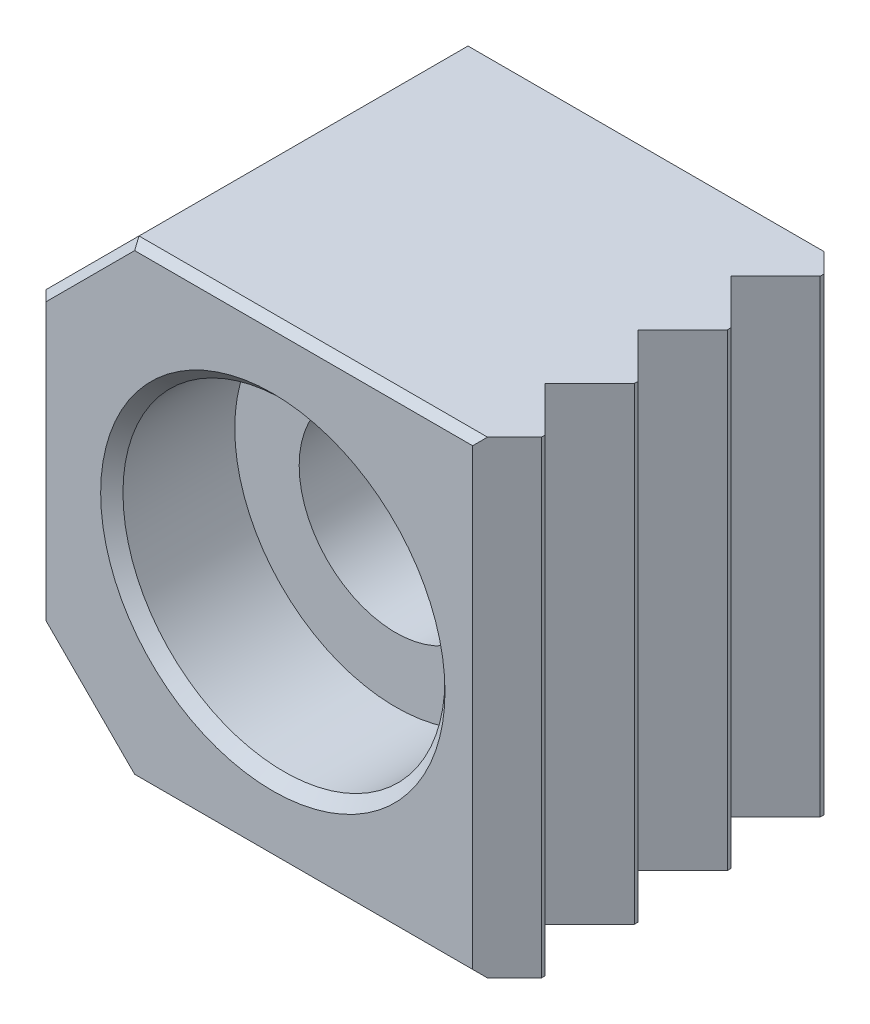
ISO-10303-21;
HEADER;
FILE_DESCRIPTION(('STEP AP214'),'2;1');
FILE_NAME('part.step','',(''),(''),'','','');
FILE_SCHEMA(('AUTOMOTIVE_DESIGN { 1 0 10303 214 1 1 1 1 }'));
ENDSEC;
DATA;
#1=APPLICATION_CONTEXT('core data for automotive mechanical design processes');
#2=APPLICATION_PROTOCOL_DEFINITION('international standard','automotive_design',2000,#1);
#3=PRODUCT_CONTEXT('',#1,'mechanical');
#4=PRODUCT('Part','Part','',(#3));
#5=PRODUCT_RELATED_PRODUCT_CATEGORY('part','',(#4));
#6=PRODUCT_DEFINITION_FORMATION('','',#4);
#7=PRODUCT_DEFINITION_CONTEXT('part definition',#1,'design');
#8=PRODUCT_DEFINITION('design','',#6,#7);
#9=PRODUCT_DEFINITION_SHAPE('','',#8);
#10=(LENGTH_UNIT() NAMED_UNIT(*) SI_UNIT(.MILLI.,.METRE.));
#11=(NAMED_UNIT(*) PLANE_ANGLE_UNIT() SI_UNIT($,.RADIAN.));
#12=(NAMED_UNIT(*) SI_UNIT($,.STERADIAN.) SOLID_ANGLE_UNIT());
#13=UNCERTAINTY_MEASURE_WITH_UNIT(LENGTH_MEASURE(1.E-05),#10,'distance_accuracy_value','');
#14=(GEOMETRIC_REPRESENTATION_CONTEXT(3) GLOBAL_UNCERTAINTY_ASSIGNED_CONTEXT((#13)) GLOBAL_UNIT_ASSIGNED_CONTEXT((#10,
#11,#12)) REPRESENTATION_CONTEXT('',''));
#15=CARTESIAN_POINT('',(0.,0.,0.));
#16=DIRECTION('',(0.,0.,1.));
#17=DIRECTION('',(1.,0.,0.));
#18=AXIS2_PLACEMENT_3D('',#15,#16,#17);
#19=CARTESIAN_POINT('',(8.,-8.,12.));
#20=DIRECTION('',(-1.,0.,0.));
#21=DIRECTION('',(0.,-1.,0.));
#22=AXIS2_PLACEMENT_3D('',#19,#20,#21);
#23=PLANE('',#22);
#24=DIRECTION('',(0.,-1.,0.));
#25=VECTOR('',#24,1.);
#26=CARTESIAN_POINT('',(8.,-8.,7.524));
#27=LINE('',#26,#25);
#28=CARTESIAN_POINT('',(8.,8.,7.524));
#29=VERTEX_POINT('',#28);
#30=CARTESIAN_POINT('',(8.,-8.,7.524));
#31=VERTEX_POINT('',#30);
#32=EDGE_CURVE('E238',#29,#31,#27,.T.);
#33=ORIENTED_EDGE('',*,*,#32,.F.);
#34=DIRECTION('',(0.,0.,-1.));
#35=VECTOR('',#34,1.);
#36=CARTESIAN_POINT('',(8.,8.,12.));
#37=LINE('',#36,#35);
#38=CARTESIAN_POINT('',(8.,8.,7.651));
#39=VERTEX_POINT('',#38);
#40=EDGE_CURVE('E440',#39,#29,#37,.T.);
#41=ORIENTED_EDGE('',*,*,#40,.F.);
#42=DIRECTION('',(0.,1.,0.));
#43=VECTOR('',#42,1.);
#44=CARTESIAN_POINT('',(8.,-8.,7.651));
#45=LINE('',#44,#43);
#46=CARTESIAN_POINT('',(8.,-8.,7.651));
#47=VERTEX_POINT('',#46);
#48=EDGE_CURVE('E236',#47,#39,#45,.T.);
#49=ORIENTED_EDGE('',*,*,#48,.F.);
#50=DIRECTION('',(0.,0.,-1.));
#51=VECTOR('',#50,1.);
#52=CARTESIAN_POINT('',(8.,-8.,12.));
#53=LINE('',#52,#51);
#54=EDGE_CURVE('E197',#47,#31,#53,.T.);
#55=ORIENTED_EDGE('',*,*,#54,.T.);
#56=EDGE_LOOP('',(#33,#41,#49,#55));
#57=FACE_BOUND('',#56,.T.);
#58=ADVANCED_FACE('F15',(#57),#23,.F.);
#59=CARTESIAN_POINT('',(8.,-8.,4.47599999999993));
#60=VERTEX_POINT('',#59);
#61=CARTESIAN_POINT('',(8.,-8.,4.34899999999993));
#62=VERTEX_POINT('',#61);
#63=EDGE_CURVE('E255',#60,#62,#53,.T.);
#64=ORIENTED_EDGE('',*,*,#63,.T.);
#65=DIRECTION('',(0.,1.,0.));
#66=VECTOR('',#65,1.);
#67=CARTESIAN_POINT('',(8.,-8.,4.34899999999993));
#68=LINE('',#67,#66);
#69=CARTESIAN_POINT('',(8.,8.,4.34899999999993));
#70=VERTEX_POINT('',#69);
#71=EDGE_CURVE('E243',#62,#70,#68,.T.);
#72=ORIENTED_EDGE('',*,*,#71,.T.);
#73=CARTESIAN_POINT('',(8.,8.,4.47599999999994));
#74=VERTEX_POINT('',#73);
#75=EDGE_CURVE('E260',#74,#70,#37,.T.);
#76=ORIENTED_EDGE('',*,*,#75,.F.);
#77=DIRECTION('',(0.,-1.,0.));
#78=VECTOR('',#77,1.);
#79=CARTESIAN_POINT('',(8.,-8.,4.47599999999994));
#80=LINE('',#79,#78);
#81=EDGE_CURVE('E240',#74,#60,#80,.T.);
#82=ORIENTED_EDGE('',*,*,#81,.T.);
#83=EDGE_LOOP('',(#64,#72,#76,#82));
#84=FACE_BOUND('',#83,.T.);
#85=ADVANCED_FACE('F413',(#84),#23,.F.);
#86=DIRECTION('',(0.,-1.,0.));
#87=VECTOR('',#86,1.);
#88=CARTESIAN_POINT('',(8.,-8.,10.699));
#89=LINE('',#88,#87);
#90=CARTESIAN_POINT('',(8.,8.,10.699));
#91=VERTEX_POINT('',#90);
#92=CARTESIAN_POINT('',(8.,-8.,10.699));
#93=VERTEX_POINT('',#92);
#94=EDGE_CURVE('E186',#91,#93,#89,.T.);
#95=ORIENTED_EDGE('',*,*,#94,.F.);
#96=CARTESIAN_POINT('',(8.,8.,10.826));
#97=VERTEX_POINT('',#96);
#98=EDGE_CURVE('E261',#97,#91,#37,.T.);
#99=ORIENTED_EDGE('',*,*,#98,.F.);
#100=DIRECTION('',(0.,1.,0.));
#101=VECTOR('',#100,1.);
#102=CARTESIAN_POINT('',(8.,-8.,10.826));
#103=LINE('',#102,#101);
#104=CARTESIAN_POINT('',(8.,-8.,10.826));
#105=VERTEX_POINT('',#104);
#106=EDGE_CURVE('E230',#105,#97,#103,.T.);
#107=ORIENTED_EDGE('',*,*,#106,.F.);
#108=EDGE_CURVE('E256',#105,#93,#53,.T.);
#109=ORIENTED_EDGE('',*,*,#108,.T.);
#110=EDGE_LOOP('',(#95,#99,#107,#109));
#111=FACE_BOUND('',#110,.T.);
#112=ADVANCED_FACE('F418',(#111),#23,.F.);
#113=CARTESIAN_POINT('',(-8.,8.,12.));
#114=DIRECTION('',(0.,1.,0.));
#115=DIRECTION('',(-1.,0.,0.));
#116=AXIS2_PLACEMENT_3D('',#113,#114,#115);
#117=PLANE('',#116);
#118=DIRECTION('',(0.,0.,1.));
#119=VECTOR('',#118,1.);
#120=CARTESIAN_POINT('',(-4.825,8.,12.));
#121=LINE('',#120,#119);
#122=CARTESIAN_POINT('',(-4.825,8.,0.508));
#123=VERTEX_POINT('',#122);
#124=CARTESIAN_POINT('',(-4.825,8.,11.746));
#125=VERTEX_POINT('',#124);
#126=EDGE_CURVE('E268',#123,#125,#121,.T.);
#127=ORIENTED_EDGE('',*,*,#126,.T.);
#128=DIRECTION('',(1.,0.,0.));
#129=VECTOR('',#128,1.);
#130=CARTESIAN_POINT('',(6.826,8.,11.746));
#131=LINE('',#130,#129);
#132=CARTESIAN_POINT('',(7.08,8.,11.746));
#133=VERTEX_POINT('',#132);
#134=EDGE_CURVE('E9',#125,#133,#131,.T.);
#135=ORIENTED_EDGE('',*,*,#134,.T.);
#136=DIRECTION('',(-0.707106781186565,0.,0.70710678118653));
#137=VECTOR('',#136,1.);
#138=CARTESIAN_POINT('',(8.0635,8.,10.7625));
#139=LINE('',#138,#137);
#140=EDGE_CURVE('E214',#97,#133,#139,.T.);
#141=ORIENTED_EDGE('',*,*,#140,.F.);
#142=ORIENTED_EDGE('',*,*,#98,.T.);
#143=DIRECTION('',(0.707106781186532,0.,0.707106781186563));
#144=VECTOR('',#143,1.);
#145=CARTESIAN_POINT('',(6.476,8.,9.175));
#146=LINE('',#145,#144);
#147=CARTESIAN_POINT('',(6.476,8.,9.175));
#148=VERTEX_POINT('',#147);
#149=EDGE_CURVE('E217',#148,#91,#146,.T.);
#150=ORIENTED_EDGE('',*,*,#149,.F.);
#151=DIRECTION('',(-0.707106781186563,0.,0.707106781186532));
#152=VECTOR('',#151,1.);
#153=CARTESIAN_POINT('',(8.0635,8.,7.5875));
#154=LINE('',#153,#152);
#155=EDGE_CURVE('E176',#39,#148,#154,.T.);
#156=ORIENTED_EDGE('',*,*,#155,.F.);
#157=ORIENTED_EDGE('',*,*,#40,.T.);
#158=DIRECTION('',(0.707106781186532,0.,0.707106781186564));
#159=VECTOR('',#158,1.);
#160=CARTESIAN_POINT('',(6.476,8.,6.));
#161=LINE('',#160,#159);
#162=CARTESIAN_POINT('',(6.476,8.,6.));
#163=VERTEX_POINT('',#162);
#164=EDGE_CURVE('E220',#163,#29,#161,.T.);
#165=ORIENTED_EDGE('',*,*,#164,.F.);
#166=DIRECTION('',(0.707106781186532,0.,-0.707106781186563));
#167=VECTOR('',#166,1.);
#168=CARTESIAN_POINT('',(6.476,8.,6.));
#169=LINE('',#168,#167);
#170=EDGE_CURVE('E222',#163,#74,#169,.T.);
#171=ORIENTED_EDGE('',*,*,#170,.T.);
#172=ORIENTED_EDGE('',*,*,#75,.T.);
#173=DIRECTION('',(-0.707106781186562,0.,-0.707106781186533));
#174=VECTOR('',#173,1.);
#175=CARTESIAN_POINT('',(8.0635,8.,4.41249999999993));
#176=LINE('',#175,#174);
#177=CARTESIAN_POINT('',(6.476,8.,2.825));
#178=VERTEX_POINT('',#177);
#179=EDGE_CURVE('E205',#70,#178,#176,.T.);
#180=ORIENTED_EDGE('',*,*,#179,.T.);
#181=DIRECTION('',(0.707106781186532,0.,-0.707106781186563));
#182=VECTOR('',#181,1.);
#183=CARTESIAN_POINT('',(6.476,8.,2.825));
#184=LINE('',#183,#182);
#185=CARTESIAN_POINT('',(8.,8.,1.30099999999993));
#186=VERTEX_POINT('',#185);
#187=EDGE_CURVE('E208',#178,#186,#184,.T.);
#188=ORIENTED_EDGE('',*,*,#187,.T.);
#189=CARTESIAN_POINT('',(8.,8.,1.17399999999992));
#190=VERTEX_POINT('',#189);
#191=EDGE_CURVE('E257',#186,#190,#37,.T.);
#192=ORIENTED_EDGE('',*,*,#191,.T.);
#193=DIRECTION('',(-0.707106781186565,0.,-0.70710678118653));
#194=VECTOR('',#193,1.);
#195=CARTESIAN_POINT('',(8.0635,8.,1.23749999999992));
#196=LINE('',#195,#194);
#197=CARTESIAN_POINT('',(7.334,8.,0.508));
#198=VERTEX_POINT('',#197);
#199=EDGE_CURVE('E211',#190,#198,#196,.T.);
#200=ORIENTED_EDGE('',*,*,#199,.T.);
#201=DIRECTION('',(-1.,0.,0.));
#202=VECTOR('',#201,1.);
#203=CARTESIAN_POINT('',(-8.,8.,0.508));
#204=LINE('',#203,#202);
#205=EDGE_CURVE('E313',#198,#123,#204,.T.);
#206=ORIENTED_EDGE('',*,*,#205,.T.);
#207=EDGE_LOOP('',(#127,#135,#141,#142,#150,#156,#157,#165,#171,#172,#180,#188,#192,#200,#206));
#208=FACE_BOUND('',#207,.T.);
#209=ADVANCED_FACE('F432',(#208),#117,.T.);
#210=CARTESIAN_POINT('',(8.,-8.,12.));
#211=DIRECTION('',(0.,-1.,0.));
#212=DIRECTION('',(1.,0.,0.));
#213=AXIS2_PLACEMENT_3D('',#210,#211,#212);
#214=PLANE('',#213);
#215=DIRECTION('',(-0.707106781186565,0.,0.70710678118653));
#216=VECTOR('',#215,1.);
#217=CARTESIAN_POINT('',(8.0635,-8.,10.7625));
#218=LINE('',#217,#216);
#219=CARTESIAN_POINT('',(7.08,-8.,11.746));
#220=VERTEX_POINT('',#219);
#221=EDGE_CURVE('E190',#105,#220,#218,.T.);
#222=ORIENTED_EDGE('',*,*,#221,.T.);
#223=DIRECTION('',(-1.,0.,0.));
#224=VECTOR('',#223,1.);
#225=CARTESIAN_POINT('',(-4.825,-8.,11.746));
#226=LINE('',#225,#224);
#227=CARTESIAN_POINT('',(-4.825,-8.,11.746));
#228=VERTEX_POINT('',#227);
#229=EDGE_CURVE('E315',#220,#228,#226,.T.);
#230=ORIENTED_EDGE('',*,*,#229,.T.);
#231=DIRECTION('',(0.,0.,-1.));
#232=VECTOR('',#231,1.);
#233=CARTESIAN_POINT('',(-4.825,-8.,0.));
#234=LINE('',#233,#232);
#235=CARTESIAN_POINT('',(-4.825,-8.,0.508));
#236=VERTEX_POINT('',#235);
#237=EDGE_CURVE('E262',#228,#236,#234,.T.);
#238=ORIENTED_EDGE('',*,*,#237,.T.);
#239=DIRECTION('',(1.,0.,0.));
#240=VECTOR('',#239,1.);
#241=CARTESIAN_POINT('',(8.,-8.,0.508));
#242=LINE('',#241,#240);
#243=CARTESIAN_POINT('',(7.334,-8.,0.508));
#244=VERTEX_POINT('',#243);
#245=EDGE_CURVE('E299',#236,#244,#242,.T.);
#246=ORIENTED_EDGE('',*,*,#245,.T.);
#247=DIRECTION('',(-0.707106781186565,0.,-0.70710678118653));
#248=VECTOR('',#247,1.);
#249=CARTESIAN_POINT('',(8.0635,-8.,1.23749999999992));
#250=LINE('',#249,#248);
#251=CARTESIAN_POINT('',(8.,-8.,1.17399999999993));
#252=VERTEX_POINT('',#251);
#253=EDGE_CURVE('E379',#252,#244,#250,.T.);
#254=ORIENTED_EDGE('',*,*,#253,.F.);
#255=CARTESIAN_POINT('',(8.,-8.,1.30099999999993));
#256=VERTEX_POINT('',#255);
#257=EDGE_CURVE('E252',#256,#252,#53,.T.);
#258=ORIENTED_EDGE('',*,*,#257,.F.);
#259=DIRECTION('',(0.707106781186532,0.,-0.707106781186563));
#260=VECTOR('',#259,1.);
#261=CARTESIAN_POINT('',(6.476,-8.,2.825));
#262=LINE('',#261,#260);
#263=CARTESIAN_POINT('',(6.476,-8.,2.825));
#264=VERTEX_POINT('',#263);
#265=EDGE_CURVE('E377',#264,#256,#262,.T.);
#266=ORIENTED_EDGE('',*,*,#265,.F.);
#267=DIRECTION('',(-0.707106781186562,0.,-0.707106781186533));
#268=VECTOR('',#267,1.);
#269=CARTESIAN_POINT('',(8.0635,-8.,4.41249999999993));
#270=LINE('',#269,#268);
#271=EDGE_CURVE('E374',#62,#264,#270,.T.);
#272=ORIENTED_EDGE('',*,*,#271,.F.);
#273=ORIENTED_EDGE('',*,*,#63,.F.);
#274=DIRECTION('',(0.707106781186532,0.,-0.707106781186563));
#275=VECTOR('',#274,1.);
#276=CARTESIAN_POINT('',(6.476,-8.,6.));
#277=LINE('',#276,#275);
#278=CARTESIAN_POINT('',(6.476,-8.,6.));
#279=VERTEX_POINT('',#278);
#280=EDGE_CURVE('E200',#279,#60,#277,.T.);
#281=ORIENTED_EDGE('',*,*,#280,.F.);
#282=DIRECTION('',(0.707106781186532,0.,0.707106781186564));
#283=VECTOR('',#282,1.);
#284=CARTESIAN_POINT('',(6.476,-8.,6.));
#285=LINE('',#284,#283);
#286=EDGE_CURVE('E198',#279,#31,#285,.T.);
#287=ORIENTED_EDGE('',*,*,#286,.T.);
#288=ORIENTED_EDGE('',*,*,#54,.F.);
#289=DIRECTION('',(-0.707106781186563,0.,0.707106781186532));
#290=VECTOR('',#289,1.);
#291=CARTESIAN_POINT('',(8.0635,-8.,7.5875));
#292=LINE('',#291,#290);
#293=CARTESIAN_POINT('',(6.476,-8.,9.175));
#294=VERTEX_POINT('',#293);
#295=EDGE_CURVE('E173',#47,#294,#292,.T.);
#296=ORIENTED_EDGE('',*,*,#295,.T.);
#297=DIRECTION('',(0.707106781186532,0.,0.707106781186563));
#298=VECTOR('',#297,1.);
#299=CARTESIAN_POINT('',(6.476,-8.,9.175));
#300=LINE('',#299,#298);
#301=EDGE_CURVE('E183',#294,#93,#300,.T.);
#302=ORIENTED_EDGE('',*,*,#301,.T.);
#303=ORIENTED_EDGE('',*,*,#108,.F.);
#304=EDGE_LOOP('',(#222,#230,#238,#246,#254,#258,#266,#272,#273,#281,#287,#288,#296,#302,#303));
#305=FACE_BOUND('',#304,.T.);
#306=ADVANCED_FACE('F194',(#305),#214,.T.);
#307=CARTESIAN_POINT('',(8.,8.,12.));
#308=DIRECTION('',(0.,0.,-1.));
#309=DIRECTION('',(1.,0.,0.));
#310=AXIS2_PLACEMENT_3D('',#307,#308,#309);
#311=PLANE('',#310);
#312=CARTESIAN_POINT('',(0.,0.,12.));
#313=DIRECTION('',(0.,0.,-1.));
#314=DIRECTION('',(1.,0.,0.));
#315=AXIS2_PLACEMENT_3D('',#312,#313,#314);
#316=CIRCLE('',#315,5.881);
#317=CARTESIAN_POINT('',(5.881,0.,12.));
#318=VERTEX_POINT('',#317);
#319=EDGE_CURVE('E279',#318,#318,#316,.T.);
#320=ORIENTED_EDGE('',*,*,#319,.T.);
#321=EDGE_LOOP('',(#320));
#322=FACE_BOUND('',#321,.T.);
#323=DIRECTION('',(0.707106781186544,-0.707106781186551,0.));
#324=VECTOR('',#323,1.);
#325=CARTESIAN_POINT('',(-4.64539487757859,-7.82039487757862,12.));
#326=LINE('',#325,#324);
#327=CARTESIAN_POINT('',(-7.746,-4.71978975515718,12.));
#328=VERTEX_POINT('',#327);
#329=CARTESIAN_POINT('',(-4.71978975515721,-7.746,12.));
#330=VERTEX_POINT('',#329);
#331=EDGE_CURVE('E324',#328,#330,#326,.T.);
#332=ORIENTED_EDGE('',*,*,#331,.T.);
#333=DIRECTION('',(1.,0.,0.));
#334=VECTOR('',#333,1.);
#335=CARTESIAN_POINT('',(6.826,-7.746,12.));
#336=LINE('',#335,#334);
#337=CARTESIAN_POINT('',(6.826,-7.746,12.));
#338=VERTEX_POINT('',#337);
#339=EDGE_CURVE('E326',#330,#338,#336,.T.);
#340=ORIENTED_EDGE('',*,*,#339,.T.);
#341=DIRECTION('',(0.,-1.,0.));
#342=VECTOR('',#341,1.);
#343=CARTESIAN_POINT('',(6.826,8.,12.));
#344=LINE('',#343,#342);
#345=CARTESIAN_POINT('',(6.826,7.746,12.));
#346=VERTEX_POINT('',#345);
#347=EDGE_CURVE('E273',#346,#338,#344,.T.);
#348=ORIENTED_EDGE('',*,*,#347,.F.);
#349=DIRECTION('',(-1.,0.,0.));
#350=VECTOR('',#349,1.);
#351=CARTESIAN_POINT('',(-4.825,7.746,12.));
#352=LINE('',#351,#350);
#353=CARTESIAN_POINT('',(-4.71978975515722,7.746,12.));
#354=VERTEX_POINT('',#353);
#355=EDGE_CURVE('E318',#346,#354,#352,.T.);
#356=ORIENTED_EDGE('',*,*,#355,.T.);
#357=DIRECTION('',(-0.707106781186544,-0.707106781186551,0.));
#358=VECTOR('',#357,1.);
#359=CARTESIAN_POINT('',(-7.82039487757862,4.64539487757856,12.));
#360=LINE('',#359,#358);
#361=CARTESIAN_POINT('',(-7.746,4.71978975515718,12.));
#362=VERTEX_POINT('',#361);
#363=EDGE_CURVE('E320',#354,#362,#360,.T.);
#364=ORIENTED_EDGE('',*,*,#363,.T.);
#365=DIRECTION('',(0.,-1.,0.));
#366=VECTOR('',#365,1.);
#367=CARTESIAN_POINT('',(-7.746,8.,12.));
#368=LINE('',#367,#366);
#369=EDGE_CURVE('E322',#362,#328,#368,.T.);
#370=ORIENTED_EDGE('',*,*,#369,.T.);
#371=EDGE_LOOP('',(#332,#340,#348,#356,#364,#370));
#372=FACE_BOUND('',#371,.T.);
#373=ADVANCED_FACE('F390',(#322,#372),#311,.F.);
#374=ORIENTED_EDGE('',*,*,#257,.T.);
#375=DIRECTION('',(0.,1.,0.));
#376=VECTOR('',#375,1.);
#377=CARTESIAN_POINT('',(8.,-8.,1.17399999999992));
#378=LINE('',#377,#376);
#379=EDGE_CURVE('E225',#252,#190,#378,.T.);
#380=ORIENTED_EDGE('',*,*,#379,.T.);
#381=ORIENTED_EDGE('',*,*,#191,.F.);
#382=DIRECTION('',(0.,-1.,0.));
#383=VECTOR('',#382,1.);
#384=CARTESIAN_POINT('',(8.,-8.,1.30099999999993));
#385=LINE('',#384,#383);
#386=EDGE_CURVE('E232',#186,#256,#385,.T.);
#387=ORIENTED_EDGE('',*,*,#386,.T.);
#388=EDGE_LOOP('',(#374,#380,#381,#387));
#389=FACE_BOUND('',#388,.T.);
#390=ADVANCED_FACE('F17',(#389),#23,.F.);
#391=CARTESIAN_POINT('',(-8.,8.,12.));
#392=DIRECTION('',(1.,0.,0.));
#393=DIRECTION('',(0.,1.,0.));
#394=AXIS2_PLACEMENT_3D('',#391,#392,#393);
#395=PLANE('',#394);
#396=DIRECTION('',(0.,0.,1.));
#397=VECTOR('',#396,1.);
#398=CARTESIAN_POINT('',(-8.,-4.825,12.));
#399=LINE('',#398,#397);
#400=CARTESIAN_POINT('',(-8.,-4.825,0.508));
#401=VERTEX_POINT('',#400);
#402=CARTESIAN_POINT('',(-8.,-4.825,11.746));
#403=VERTEX_POINT('',#402);
#404=EDGE_CURVE('E266',#401,#403,#399,.T.);
#405=ORIENTED_EDGE('',*,*,#404,.T.);
#406=DIRECTION('',(0.,1.,0.));
#407=VECTOR('',#406,1.);
#408=CARTESIAN_POINT('',(-8.,8.,11.746));
#409=LINE('',#408,#407);
#410=CARTESIAN_POINT('',(-8.,4.82499999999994,11.746));
#411=VERTEX_POINT('',#410);
#412=EDGE_CURVE('E37',#403,#411,#409,.T.);
#413=ORIENTED_EDGE('',*,*,#412,.T.);
#414=DIRECTION('',(0.,0.,-1.));
#415=VECTOR('',#414,1.);
#416=CARTESIAN_POINT('',(-8.,4.82499999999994,0.));
#417=LINE('',#416,#415);
#418=CARTESIAN_POINT('',(-8.,4.82499999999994,0.508));
#419=VERTEX_POINT('',#418);
#420=EDGE_CURVE('E264',#411,#419,#417,.T.);
#421=ORIENTED_EDGE('',*,*,#420,.T.);
#422=DIRECTION('',(0.,-1.,0.));
#423=VECTOR('',#422,1.);
#424=CARTESIAN_POINT('',(-8.,-4.825,0.508));
#425=LINE('',#424,#423);
#426=EDGE_CURVE('E308',#419,#401,#425,.T.);
#427=ORIENTED_EDGE('',*,*,#426,.T.);
#428=EDGE_LOOP('',(#405,#413,#421,#427));
#429=FACE_BOUND('',#428,.T.);
#430=ADVANCED_FACE('F343',(#429),#395,.F.);
#431=CARTESIAN_POINT('',(8.,8.,0.));
#432=DIRECTION('',(0.,0.,-1.));
#433=DIRECTION('',(1.,0.,0.));
#434=AXIS2_PLACEMENT_3D('',#431,#432,#433);
#435=PLANE('',#434);
#436=CARTESIAN_POINT('',(0.,0.,0.));
#437=DIRECTION('',(0.,0.,-1.));
#438=DIRECTION('',(1.,0.,0.));
#439=AXIS2_PLACEMENT_3D('',#436,#437,#438);
#440=CIRCLE('',#439,3.681);
#441=CARTESIAN_POINT('',(3.681,0.,0.));
#442=VERTEX_POINT('',#441);
#443=EDGE_CURVE('E282',#442,#442,#440,.F.);
#444=ORIENTED_EDGE('',*,*,#443,.T.);
#445=EDGE_LOOP('',(#444));
#446=FACE_BOUND('',#445,.T.);
#447=DIRECTION('',(0.,1.,0.));
#448=VECTOR('',#447,1.);
#449=CARTESIAN_POINT('',(6.826,8.,0.));
#450=LINE('',#449,#448);
#451=CARTESIAN_POINT('',(6.826,-7.492,0.));
#452=VERTEX_POINT('',#451);
#453=CARTESIAN_POINT('',(6.826,7.492,0.));
#454=VERTEX_POINT('',#453);
#455=EDGE_CURVE('E270',#452,#454,#450,.T.);
#456=ORIENTED_EDGE('',*,*,#455,.F.);
#457=DIRECTION('',(-1.,0.,0.));
#458=VECTOR('',#457,1.);
#459=CARTESIAN_POINT('',(8.,-7.492,0.));
#460=LINE('',#459,#458);
#461=CARTESIAN_POINT('',(-4.61457951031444,-7.492,0.));
#462=VERTEX_POINT('',#461);
#463=EDGE_CURVE('E296',#452,#462,#460,.T.);
#464=ORIENTED_EDGE('',*,*,#463,.T.);
#465=DIRECTION('',(-0.707106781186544,0.707106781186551,0.));
#466=VECTOR('',#465,1.);
#467=CARTESIAN_POINT('',(-6.05328975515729,-6.05328975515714,0.));
#468=LINE('',#467,#466);
#469=CARTESIAN_POINT('',(-7.492,-4.61457951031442,0.));
#470=VERTEX_POINT('',#469);
#471=EDGE_CURVE('E294',#462,#470,#468,.T.);
#472=ORIENTED_EDGE('',*,*,#471,.T.);
#473=DIRECTION('',(0.,1.,0.));
#474=VECTOR('',#473,1.);
#475=CARTESIAN_POINT('',(-7.492,4.82499999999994,0.));
#476=LINE('',#475,#474);
#477=CARTESIAN_POINT('',(-7.492,4.61457951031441,0.));
#478=VERTEX_POINT('',#477);
#479=EDGE_CURVE('E292',#470,#478,#476,.T.);
#480=ORIENTED_EDGE('',*,*,#479,.T.);
#481=DIRECTION('',(0.707106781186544,0.707106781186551,0.));
#482=VECTOR('',#481,1.);
#483=CARTESIAN_POINT('',(1.94671024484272,14.0532897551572,0.));
#484=LINE('',#483,#482);
#485=CARTESIAN_POINT('',(-4.61457951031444,7.492,0.));
#486=VERTEX_POINT('',#485);
#487=EDGE_CURVE('E290',#478,#486,#484,.T.);
#488=ORIENTED_EDGE('',*,*,#487,.T.);
#489=DIRECTION('',(1.,0.,0.));
#490=VECTOR('',#489,1.);
#491=CARTESIAN_POINT('',(8.,7.492,0.));
#492=LINE('',#491,#490);
#493=EDGE_CURVE('E288',#486,#454,#492,.T.);
#494=ORIENTED_EDGE('',*,*,#493,.T.);
#495=EDGE_LOOP('',(#456,#464,#472,#480,#488,#494));
#496=FACE_BOUND('',#495,.T.);
#497=ADVANCED_FACE('F427',(#446,#496),#435,.T.);
#498=CARTESIAN_POINT('',(-4.825,-8.,12.));
#499=DIRECTION('',(-0.707106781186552,-0.707106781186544,0.));
#500=DIRECTION('',(0.707106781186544,-0.707106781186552,0.));
#501=AXIS2_PLACEMENT_3D('',#498,#499,#500);
#502=PLANE('',#501);
#503=ORIENTED_EDGE('',*,*,#237,.F.);
#504=DIRECTION('',(-0.707106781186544,0.707106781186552,0.));
#505=VECTOR('',#504,1.);
#506=CARTESIAN_POINT('',(-8.,-4.82499999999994,11.746));
#507=LINE('',#506,#505);
#508=EDGE_CURVE('E332',#228,#403,#507,.T.);
#509=ORIENTED_EDGE('',*,*,#508,.T.);
#510=ORIENTED_EDGE('',*,*,#404,.F.);
#511=DIRECTION('',(0.707106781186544,-0.707106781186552,0.));
#512=VECTOR('',#511,1.);
#513=CARTESIAN_POINT('',(-4.825,-8.,0.508));
#514=LINE('',#513,#512);
#515=EDGE_CURVE('E305',#401,#236,#514,.T.);
#516=ORIENTED_EDGE('',*,*,#515,.T.);
#517=EDGE_LOOP('',(#503,#509,#510,#516));
#518=FACE_BOUND('',#517,.T.);
#519=ADVANCED_FACE('F338',(#518),#502,.T.);
#520=CARTESIAN_POINT('',(-8.,4.82499999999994,12.));
#521=DIRECTION('',(-0.707106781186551,0.707106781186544,0.));
#522=DIRECTION('',(-0.707106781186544,-0.707106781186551,0.));
#523=AXIS2_PLACEMENT_3D('',#520,#521,#522);
#524=PLANE('',#523);
#525=ORIENTED_EDGE('',*,*,#420,.F.);
#526=DIRECTION('',(0.707106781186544,0.707106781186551,0.));
#527=VECTOR('',#526,1.);
#528=CARTESIAN_POINT('',(-4.825,8.,11.746));
#529=LINE('',#528,#527);
#530=EDGE_CURVE('E23',#411,#125,#529,.T.);
#531=ORIENTED_EDGE('',*,*,#530,.T.);
#532=ORIENTED_EDGE('',*,*,#126,.F.);
#533=DIRECTION('',(-0.707106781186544,-0.707106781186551,0.));
#534=VECTOR('',#533,1.);
#535=CARTESIAN_POINT('',(-8.,4.82499999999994,0.508));
#536=LINE('',#535,#534);
#537=EDGE_CURVE('E310',#123,#419,#536,.T.);
#538=ORIENTED_EDGE('',*,*,#537,.T.);
#539=EDGE_LOOP('',(#525,#531,#532,#538));
#540=FACE_BOUND('',#539,.T.);
#541=ADVANCED_FACE('F472',(#540),#524,.T.);
#542=CARTESIAN_POINT('',(0.,0.,7.8));
#543=DIRECTION('',(0.,0.,1.));
#544=DIRECTION('',(-1.,0.,0.));
#545=AXIS2_PLACEMENT_3D('',#542,#543,#544);
#546=CYLINDRICAL_SURFACE('',#545,5.5);
#547=CARTESIAN_POINT('',(0.,0.,11.619));
#548=DIRECTION('',(0.,0.,-1.));
#549=DIRECTION('',(1.,0.,0.));
#550=AXIS2_PLACEMENT_3D('',#547,#548,#549);
#551=CIRCLE('',#550,5.5);
#552=CARTESIAN_POINT('',(5.5,0.,11.619));
#553=VERTEX_POINT('',#552);
#554=EDGE_CURVE('E276',#553,#553,#551,.F.);
#555=ORIENTED_EDGE('',*,*,#554,.T.);
#556=EDGE_LOOP('',(#555));
#557=FACE_BOUND('',#556,.T.);
#558=CARTESIAN_POINT('',(0.,0.,7.8));
#559=DIRECTION('',(0.,0.,1.));
#560=DIRECTION('',(-1.,0.,0.));
#561=AXIS2_PLACEMENT_3D('',#558,#559,#560);
#562=CIRCLE('',#561,5.5);
#563=CARTESIAN_POINT('',(-5.5,0.,7.8));
#564=VERTEX_POINT('',#563);
#565=EDGE_CURVE('E249',#564,#564,#562,.T.);
#566=ORIENTED_EDGE('',*,*,#565,.F.);
#567=EDGE_LOOP('',(#566));
#568=FACE_BOUND('',#567,.T.);
#569=ADVANCED_FACE('F474',(#557,#568),#546,.F.);
#570=CARTESIAN_POINT('',(0.,0.,7.8));
#571=DIRECTION('',(0.,0.,1.));
#572=DIRECTION('',(-1.,0.,0.));
#573=AXIS2_PLACEMENT_3D('',#570,#571,#572);
#574=PLANE('',#573);
#575=CARTESIAN_POINT('',(0.,0.,7.8));
#576=DIRECTION('',(0.,0.,1.));
#577=DIRECTION('',(-1.,0.,0.));
#578=AXIS2_PLACEMENT_3D('',#575,#576,#577);
#579=CIRCLE('',#578,3.3);
#580=CARTESIAN_POINT('',(-3.3,0.,7.8));
#581=VERTEX_POINT('',#580);
#582=EDGE_CURVE('E246',#581,#581,#579,.T.);
#583=ORIENTED_EDGE('',*,*,#582,.F.);
#584=EDGE_LOOP('',(#583));
#585=FACE_BOUND('',#584,.T.);
#586=ORIENTED_EDGE('',*,*,#565,.T.);
#587=EDGE_LOOP('',(#586));
#588=FACE_BOUND('',#587,.T.);
#589=ADVANCED_FACE('F480',(#585,#588),#574,.T.);
#590=CARTESIAN_POINT('',(0.,0.,0.));
#591=DIRECTION('',(0.,0.,1.));
#592=DIRECTION('',(-1.,0.,0.));
#593=AXIS2_PLACEMENT_3D('',#590,#591,#592);
#594=CYLINDRICAL_SURFACE('',#593,3.3);
#595=CARTESIAN_POINT('',(0.,0.,0.381));
#596=DIRECTION('',(0.,0.,-1.));
#597=DIRECTION('',(1.,0.,0.));
#598=AXIS2_PLACEMENT_3D('',#595,#596,#597);
#599=CIRCLE('',#598,3.3);
#600=CARTESIAN_POINT('',(3.3,0.,0.381));
#601=VERTEX_POINT('',#600);
#602=EDGE_CURVE('E285',#601,#601,#599,.T.);
#603=ORIENTED_EDGE('',*,*,#602,.T.);
#604=EDGE_LOOP('',(#603));
#605=FACE_BOUND('',#604,.T.);
#606=ORIENTED_EDGE('',*,*,#582,.T.);
#607=EDGE_LOOP('',(#606));
#608=FACE_BOUND('',#607,.T.);
#609=ADVANCED_FACE('F549',(#605,#608),#594,.F.);
#610=CARTESIAN_POINT('',(8.0635,8.,1.23749999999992));
#611=DIRECTION('',(-0.70710678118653,0.,0.707106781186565));
#612=DIRECTION('',(-0.707106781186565,0.,-0.70710678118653));
#613=AXIS2_PLACEMENT_3D('',#610,#611,#612);
#614=PLANE('',#613);
#615=ORIENTED_EDGE('',*,*,#253,.T.);
#616=DIRECTION('',(0.577350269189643,-0.57735026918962,0.577350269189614));
#617=VECTOR('',#616,1.);
#618=CARTESIAN_POINT('',(7.21733333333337,-7.88333333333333,0.39133333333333));
#619=LINE('',#618,#617);
#620=EDGE_CURVE('E303',#244,#452,#619,.F.);
#621=ORIENTED_EDGE('',*,*,#620,.T.);
#622=ORIENTED_EDGE('',*,*,#455,.T.);
#623=DIRECTION('',(-0.577350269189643,-0.57735026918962,-0.577350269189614));
#624=VECTOR('',#623,1.);
#625=CARTESIAN_POINT('',(7.21733333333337,7.88333333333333,0.39133333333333));
#626=LINE('',#625,#624);
#627=EDGE_CURVE('E301',#454,#198,#626,.F.);
#628=ORIENTED_EDGE('',*,*,#627,.T.);
#629=ORIENTED_EDGE('',*,*,#199,.F.);
#630=ORIENTED_EDGE('',*,*,#379,.F.);
#631=EDGE_LOOP('',(#615,#621,#622,#628,#629,#630));
#632=FACE_BOUND('',#631,.T.);
#633=ADVANCED_FACE('F558',(#632),#614,.F.);
#634=CARTESIAN_POINT('',(8.0635,8.,10.7625));
#635=DIRECTION('',(0.70710678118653,0.,0.707106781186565));
#636=DIRECTION('',(-0.707106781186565,0.,0.70710678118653));
#637=AXIS2_PLACEMENT_3D('',#634,#635,#636);
#638=PLANE('',#637);
#639=ORIENTED_EDGE('',*,*,#347,.T.);
#640=DIRECTION('',(0.577350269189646,-0.577350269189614,-0.577350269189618));
#641=VECTOR('',#640,1.);
#642=CARTESIAN_POINT('',(2.40233333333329,-3.32233333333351,16.4236666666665));
#643=LINE('',#642,#641);
#644=EDGE_CURVE('E330',#338,#220,#643,.T.);
#645=ORIENTED_EDGE('',*,*,#644,.T.);
#646=ORIENTED_EDGE('',*,*,#221,.F.);
#647=ORIENTED_EDGE('',*,*,#106,.T.);
#648=ORIENTED_EDGE('',*,*,#140,.T.);
#649=DIRECTION('',(-0.577350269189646,-0.577350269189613,0.577350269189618));
#650=VECTOR('',#649,1.);
#651=CARTESIAN_POINT('',(7.7356666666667,8.65566666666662,11.0903333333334));
#652=LINE('',#651,#650);
#653=EDGE_CURVE('E328',#133,#346,#652,.T.);
#654=ORIENTED_EDGE('',*,*,#653,.T.);
#655=EDGE_LOOP('',(#639,#645,#646,#647,#648,#654));
#656=FACE_BOUND('',#655,.T.);
#657=ADVANCED_FACE('F392',(#656),#638,.T.);
#658=CARTESIAN_POINT('',(6.476,8.,2.825));
#659=DIRECTION('',(-0.707106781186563,0.,-0.707106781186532));
#660=DIRECTION('',(0.707106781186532,0.,-0.707106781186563));
#661=AXIS2_PLACEMENT_3D('',#658,#659,#660);
#662=PLANE('',#661);
#663=ORIENTED_EDGE('',*,*,#187,.F.);
#664=DIRECTION('',(0.,-1.,0.));
#665=VECTOR('',#664,1.);
#666=CARTESIAN_POINT('',(6.476,8.,2.825));
#667=LINE('',#666,#665);
#668=EDGE_CURVE('E180',#178,#264,#667,.T.);
#669=ORIENTED_EDGE('',*,*,#668,.T.);
#670=ORIENTED_EDGE('',*,*,#265,.T.);
#671=ORIENTED_EDGE('',*,*,#386,.F.);
#672=EDGE_LOOP('',(#663,#669,#670,#671));
#673=FACE_BOUND('',#672,.T.);
#674=ADVANCED_FACE('F458',(#673),#662,.F.);
#675=CARTESIAN_POINT('',(8.0635,8.,4.41249999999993));
#676=DIRECTION('',(-0.707106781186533,0.,0.707106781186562));
#677=DIRECTION('',(-0.707106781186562,0.,-0.707106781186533));
#678=AXIS2_PLACEMENT_3D('',#675,#676,#677);
#679=PLANE('',#678);
#680=ORIENTED_EDGE('',*,*,#271,.T.);
#681=ORIENTED_EDGE('',*,*,#668,.F.);
#682=ORIENTED_EDGE('',*,*,#179,.F.);
#683=ORIENTED_EDGE('',*,*,#71,.F.);
#684=EDGE_LOOP('',(#680,#681,#682,#683));
#685=FACE_BOUND('',#684,.T.);
#686=ADVANCED_FACE('F451',(#685),#679,.F.);
#687=CARTESIAN_POINT('',(6.476,8.,9.175));
#688=DIRECTION('',(0.707106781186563,0.,-0.707106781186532));
#689=DIRECTION('',(0.707106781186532,0.,0.707106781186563));
#690=AXIS2_PLACEMENT_3D('',#687,#688,#689);
#691=PLANE('',#690);
#692=ORIENTED_EDGE('',*,*,#94,.T.);
#693=ORIENTED_EDGE('',*,*,#301,.F.);
#694=DIRECTION('',(0.,-1.,0.));
#695=VECTOR('',#694,1.);
#696=CARTESIAN_POINT('',(6.476,8.,9.175));
#697=LINE('',#696,#695);
#698=EDGE_CURVE('E169',#148,#294,#697,.T.);
#699=ORIENTED_EDGE('',*,*,#698,.F.);
#700=ORIENTED_EDGE('',*,*,#149,.T.);
#701=EDGE_LOOP('',(#692,#693,#699,#700));
#702=FACE_BOUND('',#701,.T.);
#703=ADVANCED_FACE('F184',(#702),#691,.T.);
#704=CARTESIAN_POINT('',(8.0635,8.,7.5875));
#705=DIRECTION('',(0.707106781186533,0.,0.707106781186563));
#706=DIRECTION('',(-0.707106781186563,0.,0.707106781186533));
#707=AXIS2_PLACEMENT_3D('',#704,#705,#706);
#708=PLANE('',#707);
#709=ORIENTED_EDGE('',*,*,#48,.T.);
#710=ORIENTED_EDGE('',*,*,#155,.T.);
#711=ORIENTED_EDGE('',*,*,#698,.T.);
#712=ORIENTED_EDGE('',*,*,#295,.F.);
#713=EDGE_LOOP('',(#709,#710,#711,#712));
#714=FACE_BOUND('',#713,.T.);
#715=ADVANCED_FACE('F171',(#714),#708,.T.);
#716=CARTESIAN_POINT('',(6.476,8.,6.));
#717=DIRECTION('',(-0.707106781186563,0.,-0.707106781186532));
#718=DIRECTION('',(0.707106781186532,0.,-0.707106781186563));
#719=AXIS2_PLACEMENT_3D('',#716,#717,#718);
#720=PLANE('',#719);
#721=ORIENTED_EDGE('',*,*,#170,.F.);
#722=DIRECTION('',(0.,-1.,0.));
#723=VECTOR('',#722,1.);
#724=CARTESIAN_POINT('',(6.476,8.,6.));
#725=LINE('',#724,#723);
#726=EDGE_CURVE('E179',#163,#279,#725,.T.);
#727=ORIENTED_EDGE('',*,*,#726,.T.);
#728=ORIENTED_EDGE('',*,*,#280,.T.);
#729=ORIENTED_EDGE('',*,*,#81,.F.);
#730=EDGE_LOOP('',(#721,#727,#728,#729));
#731=FACE_BOUND('',#730,.T.);
#732=ADVANCED_FACE('F608',(#731),#720,.F.);
#733=CARTESIAN_POINT('',(6.476,8.,6.));
#734=DIRECTION('',(0.707106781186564,0.,-0.707106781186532));
#735=DIRECTION('',(0.707106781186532,0.,0.707106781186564));
#736=AXIS2_PLACEMENT_3D('',#733,#734,#735);
#737=PLANE('',#736);
#738=ORIENTED_EDGE('',*,*,#32,.T.);
#739=ORIENTED_EDGE('',*,*,#286,.F.);
#740=ORIENTED_EDGE('',*,*,#726,.F.);
#741=ORIENTED_EDGE('',*,*,#164,.T.);
#742=EDGE_LOOP('',(#738,#739,#740,#741));
#743=FACE_BOUND('',#742,.T.);
#744=ADVANCED_FACE('F617',(#743),#737,.T.);
#745=CARTESIAN_POINT('',(0.,0.,11.619));
#746=DIRECTION('',(0.,0.,1.));
#747=DIRECTION('',(-1.,0.,0.));
#748=AXIS2_PLACEMENT_3D('',#745,#746,#747);
#749=CONICAL_SURFACE('',#748,5.5,0.785398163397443);
#750=ORIENTED_EDGE('',*,*,#319,.F.);
#751=EDGE_LOOP('',(#750));
#752=FACE_BOUND('',#751,.T.);
#753=ORIENTED_EDGE('',*,*,#554,.F.);
#754=EDGE_LOOP('',(#753));
#755=FACE_BOUND('',#754,.T.);
#756=ADVANCED_FACE('F627',(#752,#755),#749,.F.);
#757=CARTESIAN_POINT('',(0.,0.,0.));
#758=DIRECTION('',(0.,0.,-1.));
#759=DIRECTION('',(1.,0.,0.));
#760=AXIS2_PLACEMENT_3D('',#757,#758,#759);
#761=CONICAL_SURFACE('',#760,3.681,0.785398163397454);
#762=ORIENTED_EDGE('',*,*,#602,.F.);
#763=EDGE_LOOP('',(#762));
#764=FACE_BOUND('',#763,.T.);
#765=ORIENTED_EDGE('',*,*,#443,.F.);
#766=EDGE_LOOP('',(#765));
#767=FACE_BOUND('',#766,.T.);
#768=ADVANCED_FACE('F637',(#764,#767),#761,.F.);
#769=CARTESIAN_POINT('',(8.,7.492,0.));
#770=DIRECTION('',(0.,-0.707106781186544,0.707106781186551));
#771=DIRECTION('',(0.,-0.707106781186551,-0.707106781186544));
#772=AXIS2_PLACEMENT_3D('',#769,#770,#771);
#773=PLANE('',#772);
#774=ORIENTED_EDGE('',*,*,#627,.F.);
#775=ORIENTED_EDGE('',*,*,#493,.F.);
#776=DIRECTION('',(-0.281084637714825,0.67859834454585,0.678598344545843));
#777=VECTOR('',#776,1.);
#778=CARTESIAN_POINT('',(-3.61791957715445,5.0858500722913,-2.40614992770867));
#779=LINE('',#778,#777);
#780=EDGE_CURVE('E371',#123,#486,#779,.F.);
#781=ORIENTED_EDGE('',*,*,#780,.F.);
#782=ORIENTED_EDGE('',*,*,#205,.F.);
#783=EDGE_LOOP('',(#774,#775,#781,#782));
#784=FACE_BOUND('',#783,.T.);
#785=ADVANCED_FACE('F465',(#784),#773,.F.);
#786=CARTESIAN_POINT('',(1.94671024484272,14.0532897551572,0.));
#787=DIRECTION('',(0.5,-0.5,0.707106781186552));
#788=DIRECTION('',(-0.816496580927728,0.,0.577350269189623));
#789=AXIS2_PLACEMENT_3D('',#786,#787,#788);
#790=PLANE('',#789);
#791=ORIENTED_EDGE('',*,*,#780,.T.);
#792=ORIENTED_EDGE('',*,*,#487,.F.);
#793=DIRECTION('',(0.67859834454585,-0.281084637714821,-0.678598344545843));
#794=VECTOR('',#793,1.);
#795=CARTESIAN_POINT('',(-4.94588768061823,3.55994525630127,-2.54611231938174));
#796=LINE('',#795,#794);
#797=EDGE_CURVE('E368',#419,#478,#796,.T.);
#798=ORIENTED_EDGE('',*,*,#797,.F.);
#799=ORIENTED_EDGE('',*,*,#537,.F.);
#800=EDGE_LOOP('',(#791,#792,#798,#799));
#801=FACE_BOUND('',#800,.T.);
#802=ADVANCED_FACE('F471',(#801),#790,.F.);
#803=CARTESIAN_POINT('',(-8.,8.,0.508));
#804=DIRECTION('',(-0.707106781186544,0.,-0.707106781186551));
#805=DIRECTION('',(0.707106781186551,0.,-0.707106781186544));
#806=AXIS2_PLACEMENT_3D('',#803,#804,#805);
#807=PLANE('',#806);
#808=ORIENTED_EDGE('',*,*,#797,.T.);
#809=ORIENTED_EDGE('',*,*,#479,.F.);
#810=DIRECTION('',(0.678598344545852,0.281084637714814,-0.678598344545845));
#811=VECTOR('',#810,1.);
#812=CARTESIAN_POINT('',(-5.55371371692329,-3.81171504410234,-1.93828628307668));
#813=LINE('',#812,#811);
#814=EDGE_CURVE('E365',#401,#470,#813,.T.);
#815=ORIENTED_EDGE('',*,*,#814,.F.);
#816=ORIENTED_EDGE('',*,*,#426,.F.);
#817=EDGE_LOOP('',(#808,#809,#815,#816));
#818=FACE_BOUND('',#817,.T.);
#819=ADVANCED_FACE('F664',(#818),#807,.T.);
#820=CARTESIAN_POINT('',(-6.05328975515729,-6.05328975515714,0.));
#821=DIRECTION('',(0.5,0.5,0.707106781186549));
#822=DIRECTION('',(-0.816496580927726,0.,0.577350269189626));
#823=AXIS2_PLACEMENT_3D('',#820,#821,#822);
#824=PLANE('',#823);
#825=ORIENTED_EDGE('',*,*,#814,.T.);
#826=ORIENTED_EDGE('',*,*,#471,.F.);
#827=DIRECTION('',(-0.281084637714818,-0.678598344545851,0.678598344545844));
#828=VECTOR('',#827,1.);
#829=CARTESIAN_POINT('',(-4.45382522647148,-7.10390482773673,-0.388095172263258));
#830=LINE('',#829,#828);
#831=EDGE_CURVE('E363',#236,#462,#830,.F.);
#832=ORIENTED_EDGE('',*,*,#831,.F.);
#833=ORIENTED_EDGE('',*,*,#515,.F.);
#834=EDGE_LOOP('',(#825,#826,#832,#833));
#835=FACE_BOUND('',#834,.T.);
#836=ADVANCED_FACE('F673',(#835),#824,.F.);
#837=CARTESIAN_POINT('',(8.,-7.492,0.));
#838=DIRECTION('',(0.,0.707106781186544,0.707106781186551));
#839=DIRECTION('',(0.,-0.707106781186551,0.707106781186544));
#840=AXIS2_PLACEMENT_3D('',#837,#838,#839);
#841=PLANE('',#840);
#842=ORIENTED_EDGE('',*,*,#620,.F.);
#843=ORIENTED_EDGE('',*,*,#245,.F.);
#844=ORIENTED_EDGE('',*,*,#831,.T.);
#845=ORIENTED_EDGE('',*,*,#463,.F.);
#846=EDGE_LOOP('',(#842,#843,#844,#845));
#847=FACE_BOUND('',#846,.T.);
#848=ADVANCED_FACE('F410',(#847),#841,.F.);
#849=CARTESIAN_POINT('',(-8.,8.,11.746));
#850=DIRECTION('',(0.,0.707106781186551,0.707106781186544));
#851=DIRECTION('',(0.,-0.707106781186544,0.707106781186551));
#852=AXIS2_PLACEMENT_3D('',#849,#850,#851);
#853=PLANE('',#852);
#854=ORIENTED_EDGE('',*,*,#653,.F.);
#855=ORIENTED_EDGE('',*,*,#134,.F.);
#856=DIRECTION('',(0.281084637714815,-0.678598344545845,0.678598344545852));
#857=VECTOR('',#856,1.);
#858=CARTESIAN_POINT('',(-5.07585222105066,8.60561083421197,11.140389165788));
#859=LINE('',#858,#857);
#860=EDGE_CURVE('E357',#354,#125,#859,.F.);
#861=ORIENTED_EDGE('',*,*,#860,.F.);
#862=ORIENTED_EDGE('',*,*,#355,.F.);
#863=EDGE_LOOP('',(#854,#855,#861,#862));
#864=FACE_BOUND('',#863,.T.);
#865=ADVANCED_FACE('F397',(#864),#853,.T.);
#866=CARTESIAN_POINT('',(1.76710512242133,14.2328948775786,12.));
#867=DIRECTION('',(-0.500000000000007,0.5,0.707106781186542));
#868=DIRECTION('',(-0.81649658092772,0.,-0.577350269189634));
#869=AXIS2_PLACEMENT_3D('',#866,#867,#868);
#870=PLANE('',#869);
#871=ORIENTED_EDGE('',*,*,#860,.T.);
#872=ORIENTED_EDGE('',*,*,#530,.F.);
#873=DIRECTION('',(-0.678598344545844,0.281084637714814,-0.678598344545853));
#874=VECTOR('',#873,1.);
#875=CARTESIAN_POINT('',(-5.1798195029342,3.65684298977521,14.5661804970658));
#876=LINE('',#875,#874);
#877=EDGE_CURVE('E353',#362,#411,#876,.T.);
#878=ORIENTED_EDGE('',*,*,#877,.F.);
#879=ORIENTED_EDGE('',*,*,#363,.F.);
#880=EDGE_LOOP('',(#871,#872,#878,#879));
#881=FACE_BOUND('',#880,.T.);
#882=ADVANCED_FACE('F401',(#881),#870,.T.);
#883=CARTESIAN_POINT('',(-7.746,8.,12.));
#884=DIRECTION('',(0.707106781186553,0.,-0.707106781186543));
#885=DIRECTION('',(0.707106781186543,0.,0.707106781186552));
#886=AXIS2_PLACEMENT_3D('',#883,#884,#885);
#887=PLANE('',#886);
#888=ORIENTED_EDGE('',*,*,#877,.T.);
#889=ORIENTED_EDGE('',*,*,#412,.F.);
#890=DIRECTION('',(-0.678598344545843,-0.28108463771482,-0.678598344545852));
#891=VECTOR('',#890,1.);
#892=CARTESIAN_POINT('',(-5.31978189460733,-3.71481731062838,14.4262181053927));
#893=LINE('',#892,#891);
#894=EDGE_CURVE('E350',#328,#403,#893,.T.);
#895=ORIENTED_EDGE('',*,*,#894,.F.);
#896=ORIENTED_EDGE('',*,*,#369,.F.);
#897=EDGE_LOOP('',(#888,#889,#895,#896));
#898=FACE_BOUND('',#897,.T.);
#899=ADVANCED_FACE('F348',(#898),#887,.F.);
#900=CARTESIAN_POINT('',(-6.23289487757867,-6.23289487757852,12.));
#901=DIRECTION('',(-0.5,-0.5,0.707106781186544));
#902=DIRECTION('',(-0.816496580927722,0.,-0.577350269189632));
#903=AXIS2_PLACEMENT_3D('',#900,#901,#902);
#904=PLANE('',#903);
#905=ORIENTED_EDGE('',*,*,#894,.T.);
#906=ORIENTED_EDGE('',*,*,#508,.F.);
#907=DIRECTION('',(0.281084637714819,0.678598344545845,0.67859834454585));
#908=VECTOR('',#907,1.);
#909=CARTESIAN_POINT('',(-4.5507229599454,-7.33783665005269,12.4081633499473));
#910=LINE('',#909,#908);
#911=EDGE_CURVE('E355',#330,#228,#910,.F.);
#912=ORIENTED_EDGE('',*,*,#911,.F.);
#913=ORIENTED_EDGE('',*,*,#331,.F.);
#914=EDGE_LOOP('',(#905,#906,#912,#913));
#915=FACE_BOUND('',#914,.T.);
#916=ADVANCED_FACE('F354',(#915),#904,.T.);
#917=CARTESIAN_POINT('',(8.,-8.,11.746));
#918=DIRECTION('',(0.,-0.70710678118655,0.707106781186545));
#919=DIRECTION('',(0.,-0.707106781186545,-0.70710678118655));
#920=AXIS2_PLACEMENT_3D('',#917,#918,#919);
#921=PLANE('',#920);
#922=ORIENTED_EDGE('',*,*,#644,.F.);
#923=ORIENTED_EDGE('',*,*,#339,.F.);
#924=ORIENTED_EDGE('',*,*,#911,.T.);
#925=ORIENTED_EDGE('',*,*,#229,.F.);
#926=EDGE_LOOP('',(#922,#923,#924,#925));
#927=FACE_BOUND('',#926,.T.);
#928=ADVANCED_FACE('F386',(#927),#921,.T.);
#929=CLOSED_SHELL('',(#58,#85,#112,#209,#306,#373,#390,#430,#497,#519,#541,#569,#589,#609,#633,
#657,#674,#686,#703,#715,#732,#744,#756,#768,#785,#802,#819,#836,#848,#865,#882,#899,#916,#928));
#930=MANIFOLD_SOLID_BREP('B1',#929);
#931=ADVANCED_BREP_SHAPE_REPRESENTATION('',(#18,#930),#14);
#932=SHAPE_DEFINITION_REPRESENTATION(#9,#931);
ENDSEC;
END-ISO-10303-21;
